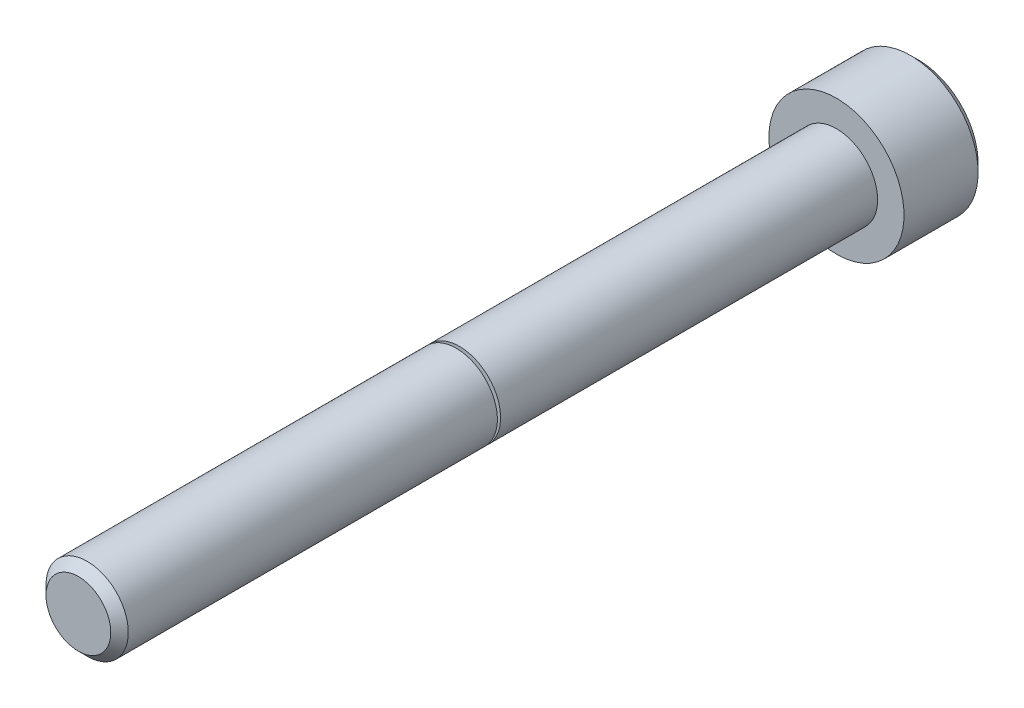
ISO-10303-21;
HEADER;
FILE_DESCRIPTION(('STEP AP214'),'2;1');
FILE_NAME('part.step','',(''),(''),'','','');
FILE_SCHEMA(('AUTOMOTIVE_DESIGN { 1 0 10303 214 1 1 1 1 }'));
ENDSEC;
DATA;
#1=APPLICATION_CONTEXT('core data for automotive mechanical design processes');
#2=APPLICATION_PROTOCOL_DEFINITION('international standard','automotive_design',2000,#1);
#3=PRODUCT_CONTEXT('',#1,'mechanical');
#4=PRODUCT('Part','Part','',(#3));
#5=PRODUCT_RELATED_PRODUCT_CATEGORY('part','',(#4));
#6=PRODUCT_DEFINITION_FORMATION('','',#4);
#7=PRODUCT_DEFINITION_CONTEXT('part definition',#1,'design');
#8=PRODUCT_DEFINITION('design','',#6,#7);
#9=PRODUCT_DEFINITION_SHAPE('','',#8);
#10=(LENGTH_UNIT() NAMED_UNIT(*) SI_UNIT(.MILLI.,.METRE.));
#11=(NAMED_UNIT(*) PLANE_ANGLE_UNIT() SI_UNIT($,.RADIAN.));
#12=(NAMED_UNIT(*) SI_UNIT($,.STERADIAN.) SOLID_ANGLE_UNIT());
#13=UNCERTAINTY_MEASURE_WITH_UNIT(LENGTH_MEASURE(1.E-05),#10,'distance_accuracy_value','');
#14=(GEOMETRIC_REPRESENTATION_CONTEXT(3) GLOBAL_UNCERTAINTY_ASSIGNED_CONTEXT((#13)) GLOBAL_UNIT_ASSIGNED_CONTEXT((#10,
#11,#12)) REPRESENTATION_CONTEXT('',''));
#15=CARTESIAN_POINT('',(0.,0.,0.));
#16=DIRECTION('',(0.,0.,1.));
#17=DIRECTION('',(1.,0.,0.));
#18=AXIS2_PLACEMENT_3D('',#15,#16,#17);
#19=CARTESIAN_POINT('',(0.,0.,-4.826));
#20=DIRECTION('',(0.,0.,1.));
#21=DIRECTION('',(1.,0.,0.));
#22=AXIS2_PLACEMENT_3D('',#19,#20,#21);
#23=PLANE('',#22);
#24=DIRECTION('',(-0.5,-0.866025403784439,0.));
#25=VECTOR('',#24,1.);
#26=CARTESIAN_POINT('',(2.29135888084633,0.,-4.826));
#27=LINE('',#26,#25);
#28=CARTESIAN_POINT('',(2.29135888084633,0.,-4.826));
#29=VERTEX_POINT('',#28);
#30=CARTESIAN_POINT('',(1.14567944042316,-1.984375,-4.826));
#31=VERTEX_POINT('',#30);
#32=EDGE_CURVE('E145',#29,#31,#27,.T.);
#33=ORIENTED_EDGE('',*,*,#32,.F.);
#34=DIRECTION('',(0.499999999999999,-0.866025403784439,0.));
#35=VECTOR('',#34,1.);
#36=CARTESIAN_POINT('',(1.14567944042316,1.984375,-4.826));
#37=LINE('',#36,#35);
#38=CARTESIAN_POINT('',(1.14567944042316,1.984375,-4.826));
#39=VERTEX_POINT('',#38);
#40=EDGE_CURVE('E64',#39,#29,#37,.T.);
#41=ORIENTED_EDGE('',*,*,#40,.F.);
#42=DIRECTION('',(1.,0.,0.));
#43=VECTOR('',#42,1.);
#44=CARTESIAN_POINT('',(-1.14567944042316,1.984375,-4.826));
#45=LINE('',#44,#43);
#46=CARTESIAN_POINT('',(-1.14567944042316,1.984375,-4.826));
#47=VERTEX_POINT('',#46);
#48=EDGE_CURVE('E158',#47,#39,#45,.T.);
#49=ORIENTED_EDGE('',*,*,#48,.F.);
#50=DIRECTION('',(0.5,0.866025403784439,0.));
#51=VECTOR('',#50,1.);
#52=CARTESIAN_POINT('',(-2.29135888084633,0.,-4.826));
#53=LINE('',#52,#51);
#54=CARTESIAN_POINT('',(-2.29135888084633,0.,-4.826));
#55=VERTEX_POINT('',#54);
#56=EDGE_CURVE('E155',#55,#47,#53,.T.);
#57=ORIENTED_EDGE('',*,*,#56,.F.);
#58=DIRECTION('',(-0.5,0.866025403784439,0.));
#59=VECTOR('',#58,1.);
#60=CARTESIAN_POINT('',(-1.14567944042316,-1.984375,-4.826));
#61=LINE('',#60,#59);
#62=CARTESIAN_POINT('',(-1.14567944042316,-1.984375,-4.826));
#63=VERTEX_POINT('',#62);
#64=EDGE_CURVE('E112',#63,#55,#61,.T.);
#65=ORIENTED_EDGE('',*,*,#64,.F.);
#66=DIRECTION('',(-1.,0.,0.));
#67=VECTOR('',#66,1.);
#68=CARTESIAN_POINT('',(1.14567944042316,-1.984375,-4.826));
#69=LINE('',#68,#67);
#70=EDGE_CURVE('E149',#31,#63,#69,.T.);
#71=ORIENTED_EDGE('',*,*,#70,.F.);
#72=EDGE_LOOP('',(#33,#41,#49,#57,#65,#71));
#73=FACE_BOUND('',#72,.T.);
#74=CARTESIAN_POINT('',(0.,0.,-4.826));
#75=DIRECTION('',(0.,0.,-1.));
#76=DIRECTION('',(-1.,0.,0.));
#77=AXIS2_PLACEMENT_3D('',#74,#75,#76);
#78=CIRCLE('',#77,3.4798);
#79=CARTESIAN_POINT('',(-3.4798,0.,-4.826));
#80=VERTEX_POINT('',#79);
#81=EDGE_CURVE('E164',#80,#80,#78,.T.);
#82=ORIENTED_EDGE('',*,*,#81,.T.);
#83=EDGE_LOOP('',(#82));
#84=FACE_BOUND('',#83,.T.);
#85=ADVANCED_FACE('F49',(#73,#84),#23,.F.);
#86=CARTESIAN_POINT('',(-1.89865000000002,0.,44.45));
#87=DIRECTION('',(0.,0.,-1.));
#88=DIRECTION('',(-1.,0.,0.));
#89=AXIS2_PLACEMENT_3D('',#86,#87,#88);
#90=PLANE('',#89);
#91=CARTESIAN_POINT('',(0.,0.,44.45));
#92=DIRECTION('',(0.,0.,-1.));
#93=DIRECTION('',(-1.,0.,0.));
#94=AXIS2_PLACEMENT_3D('',#91,#92,#93);
#95=CIRCLE('',#94,1.89865000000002);
#96=CARTESIAN_POINT('',(-1.89865000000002,0.,44.45));
#97=VERTEX_POINT('',#96);
#98=EDGE_CURVE('E11',#97,#97,#95,.T.);
#99=ORIENTED_EDGE('',*,*,#98,.F.);
#100=EDGE_LOOP('',(#99));
#101=FACE_BOUND('',#100,.T.);
#102=ADVANCED_FACE('F214',(#101),#90,.F.);
#103=CARTESIAN_POINT('',(0.,0.,44.45));
#104=DIRECTION('',(0.,0.,-1.));
#105=DIRECTION('',(-1.,0.,0.));
#106=AXIS2_PLACEMENT_3D('',#103,#104,#105);
#107=CONICAL_SURFACE('',#106,1.89865000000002,0.785398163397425);
#108=CARTESIAN_POINT('',(0.,0.,43.93565));
#109=DIRECTION('',(0.,0.,-1.));
#110=DIRECTION('',(-1.,0.,0.));
#111=AXIS2_PLACEMENT_3D('',#108,#109,#110);
#112=CIRCLE('',#111,2.41300000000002);
#113=CARTESIAN_POINT('',(-2.41300000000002,0.,43.93565));
#114=VERTEX_POINT('',#113);
#115=EDGE_CURVE('E57',#114,#114,#112,.T.);
#116=ORIENTED_EDGE('',*,*,#115,.F.);
#117=EDGE_LOOP('',(#116));
#118=FACE_BOUND('',#117,.T.);
#119=ORIENTED_EDGE('',*,*,#98,.T.);
#120=EDGE_LOOP('',(#119));
#121=FACE_BOUND('',#120,.T.);
#122=ADVANCED_FACE('F211',(#118,#121),#107,.T.);
#123=CARTESIAN_POINT('',(0.,0.,-10.585154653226));
#124=DIRECTION('',(0.,0.,-1.));
#125=DIRECTION('',(-1.,0.,0.));
#126=AXIS2_PLACEMENT_3D('',#123,#124,#125);
#127=CYLINDRICAL_SURFACE('',#126,2.41300000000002);
#128=CARTESIAN_POINT('',(0.,0.,22.2952080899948));
#129=DIRECTION('',(0.,0.,-1.));
#130=DIRECTION('',(-1.,0.,0.));
#131=AXIS2_PLACEMENT_3D('',#128,#129,#130);
#132=CIRCLE('',#131,2.41300000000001);
#133=CARTESIAN_POINT('',(-2.41300000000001,0.,22.2952080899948));
#134=VERTEX_POINT('',#133);
#135=EDGE_CURVE('E201',#134,#134,#132,.T.);
#136=ORIENTED_EDGE('',*,*,#135,.F.);
#137=EDGE_LOOP('',(#136));
#138=FACE_BOUND('',#137,.T.);
#139=ORIENTED_EDGE('',*,*,#115,.T.);
#140=EDGE_LOOP('',(#139));
#141=FACE_BOUND('',#140,.T.);
#142=ADVANCED_FACE('F209',(#138,#141),#127,.T.);
#143=CARTESIAN_POINT('',(0.,0.,22.2952080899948));
#144=DIRECTION('',(0.,0.,1.));
#145=DIRECTION('',(1.,0.,0.));
#146=AXIS2_PLACEMENT_3D('',#143,#144,#145);
#147=CONICAL_SURFACE('',#146,2.41300000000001,1.22173047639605);
#148=CARTESIAN_POINT('',(0.,0.,22.1467938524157));
#149=DIRECTION('',(0.,0.,-1.));
#150=DIRECTION('',(-1.,0.,0.));
#151=AXIS2_PLACEMENT_3D('',#148,#149,#150);
#152=CIRCLE('',#151,2.00523523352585);
#153=CARTESIAN_POINT('',(-2.00523523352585,0.,22.1467938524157));
#154=VERTEX_POINT('',#153);
#155=EDGE_CURVE('E197',#154,#154,#152,.T.);
#156=ORIENTED_EDGE('',*,*,#155,.F.);
#157=EDGE_LOOP('',(#156));
#158=FACE_BOUND('',#157,.T.);
#159=ORIENTED_EDGE('',*,*,#135,.T.);
#160=EDGE_LOOP('',(#159));
#161=FACE_BOUND('',#160,.T.);
#162=ADVANCED_FACE('F226',(#158,#161),#147,.T.);
#163=CARTESIAN_POINT('',(0.,0.,22.128));
#164=DIRECTION('',(0.,0.,-1.));
#165=DIRECTION('',(-1.,0.,0.));
#166=AXIS2_PLACEMENT_3D('',#163,#164,#165);
#167=TOROIDAL_SURFACE('',#166,2.01207563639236,0.0199999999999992);
#168=CARTESIAN_POINT('',(0.,0.,22.108));
#169=DIRECTION('',(0.,0.,-1.));
#170=DIRECTION('',(-1.,0.,0.));
#171=AXIS2_PLACEMENT_3D('',#168,#169,#170);
#172=CIRCLE('',#171,2.01207563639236);
#173=CARTESIAN_POINT('',(-2.01207563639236,0.,22.108));
#174=VERTEX_POINT('',#173);
#175=EDGE_CURVE('E193',#174,#174,#172,.T.);
#176=ORIENTED_EDGE('',*,*,#175,.F.);
#177=EDGE_LOOP('',(#176));
#178=FACE_BOUND('',#177,.T.);
#179=ORIENTED_EDGE('',*,*,#155,.T.);
#180=EDGE_LOOP('',(#179));
#181=FACE_BOUND('',#180,.T.);
#182=ADVANCED_FACE('F230',(#178,#181),#167,.F.);
#183=CARTESIAN_POINT('',(-2.41300000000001,0.,22.108));
#184=DIRECTION('',(0.,0.,-1.));
#185=DIRECTION('',(-1.,0.,0.));
#186=AXIS2_PLACEMENT_3D('',#183,#184,#185);
#187=PLANE('',#186);
#188=CARTESIAN_POINT('',(0.,0.,22.108));
#189=DIRECTION('',(0.,0.,-1.));
#190=DIRECTION('',(-1.,0.,0.));
#191=AXIS2_PLACEMENT_3D('',#188,#189,#190);
#192=CIRCLE('',#191,2.41300000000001);
#193=CARTESIAN_POINT('',(-2.41300000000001,0.,22.108));
#194=VERTEX_POINT('',#193);
#195=EDGE_CURVE('E189',#194,#194,#192,.T.);
#196=ORIENTED_EDGE('',*,*,#195,.F.);
#197=EDGE_LOOP('',(#196));
#198=FACE_BOUND('',#197,.T.);
#199=ORIENTED_EDGE('',*,*,#175,.T.);
#200=EDGE_LOOP('',(#199));
#201=FACE_BOUND('',#200,.T.);
#202=ADVANCED_FACE('F234',(#198,#201),#187,.F.);
#203=CARTESIAN_POINT('',(0.,0.,-10.585154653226));
#204=DIRECTION('',(0.,0.,-1.));
#205=DIRECTION('',(-1.,0.,0.));
#206=AXIS2_PLACEMENT_3D('',#203,#204,#205);
#207=CYLINDRICAL_SURFACE('',#206,2.41300000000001);
#208=CARTESIAN_POINT('',(0.,0.,0.));
#209=DIRECTION('',(0.,0.,-1.));
#210=DIRECTION('',(-1.,0.,0.));
#211=AXIS2_PLACEMENT_3D('',#208,#209,#210);
#212=CIRCLE('',#211,2.413);
#213=CARTESIAN_POINT('',(-2.413,0.,0.));
#214=VERTEX_POINT('',#213);
#215=EDGE_CURVE('E185',#214,#214,#212,.T.);
#216=ORIENTED_EDGE('',*,*,#215,.F.);
#217=EDGE_LOOP('',(#216));
#218=FACE_BOUND('',#217,.T.);
#219=ORIENTED_EDGE('',*,*,#195,.T.);
#220=EDGE_LOOP('',(#219));
#221=FACE_BOUND('',#220,.T.);
#222=ADVANCED_FACE('F238',(#218,#221),#207,.T.);
#223=CARTESIAN_POINT('',(-3.96240000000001,0.,0.));
#224=DIRECTION('',(0.,0.,-1.));
#225=DIRECTION('',(-1.,0.,0.));
#226=AXIS2_PLACEMENT_3D('',#223,#224,#225);
#227=PLANE('',#226);
#228=CARTESIAN_POINT('',(0.,0.,0.));
#229=DIRECTION('',(0.,0.,-1.));
#230=DIRECTION('',(-1.,0.,0.));
#231=AXIS2_PLACEMENT_3D('',#228,#229,#230);
#232=CIRCLE('',#231,3.96240000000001);
#233=CARTESIAN_POINT('',(-3.96240000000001,0.,0.));
#234=VERTEX_POINT('',#233);
#235=EDGE_CURVE('E181',#234,#234,#232,.T.);
#236=ORIENTED_EDGE('',*,*,#235,.F.);
#237=EDGE_LOOP('',(#236));
#238=FACE_BOUND('',#237,.T.);
#239=ORIENTED_EDGE('',*,*,#215,.T.);
#240=EDGE_LOOP('',(#239));
#241=FACE_BOUND('',#240,.T.);
#242=ADVANCED_FACE('F242',(#238,#241),#227,.F.);
#243=CARTESIAN_POINT('',(0.,0.,-10.585154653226));
#244=DIRECTION('',(0.,0.,-1.));
#245=DIRECTION('',(-1.,0.,0.));
#246=AXIS2_PLACEMENT_3D('',#243,#244,#245);
#247=CYLINDRICAL_SURFACE('',#246,3.9624);
#248=CARTESIAN_POINT('',(0.,0.,-4.3434));
#249=DIRECTION('',(0.,0.,-1.));
#250=DIRECTION('',(-1.,0.,0.));
#251=AXIS2_PLACEMENT_3D('',#248,#249,#250);
#252=CIRCLE('',#251,3.9624);
#253=CARTESIAN_POINT('',(-3.9624,0.,-4.3434));
#254=VERTEX_POINT('',#253);
#255=EDGE_CURVE('E177',#254,#254,#252,.T.);
#256=ORIENTED_EDGE('',*,*,#255,.F.);
#257=EDGE_LOOP('',(#256));
#258=FACE_BOUND('',#257,.T.);
#259=ORIENTED_EDGE('',*,*,#235,.T.);
#260=EDGE_LOOP('',(#259));
#261=FACE_BOUND('',#260,.T.);
#262=ADVANCED_FACE('F246',(#258,#261),#247,.T.);
#263=CARTESIAN_POINT('',(0.,0.,-4.3434));
#264=DIRECTION('',(0.,0.,1.));
#265=DIRECTION('',(1.,0.,0.));
#266=AXIS2_PLACEMENT_3D('',#263,#264,#265);
#267=CONICAL_SURFACE('',#266,3.9624,0.785398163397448);
#268=ORIENTED_EDGE('',*,*,#81,.F.);
#269=EDGE_LOOP('',(#268));
#270=FACE_BOUND('',#269,.T.);
#271=ORIENTED_EDGE('',*,*,#255,.T.);
#272=EDGE_LOOP('',(#271));
#273=FACE_BOUND('',#272,.T.);
#274=ADVANCED_FACE('F250',(#270,#273),#267,.T.);
#275=CARTESIAN_POINT('',(1.14567944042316,1.984375,-2.413));
#276=DIRECTION('',(0.866025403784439,0.499999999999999,0.));
#277=DIRECTION('',(-0.499999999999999,0.866025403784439,0.));
#278=AXIS2_PLACEMENT_3D('',#275,#276,#277);
#279=PLANE('',#278);
#280=ORIENTED_EDGE('',*,*,#40,.T.);
#281=DIRECTION('',(0.,0.,-1.));
#282=VECTOR('',#281,1.);
#283=CARTESIAN_POINT('',(2.29135888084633,0.,-2.413));
#284=LINE('',#283,#282);
#285=CARTESIAN_POINT('',(2.29135888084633,0.,-2.413));
#286=VERTEX_POINT('',#285);
#287=EDGE_CURVE('E94',#286,#29,#284,.T.);
#288=ORIENTED_EDGE('',*,*,#287,.F.);
#289=DIRECTION('',(0.499999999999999,-0.866025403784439,0.));
#290=VECTOR('',#289,1.);
#291=CARTESIAN_POINT('',(1.14567944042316,1.984375,-2.413));
#292=LINE('',#291,#290);
#293=CARTESIAN_POINT('',(1.14567944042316,1.984375,-2.413));
#294=VERTEX_POINT('',#293);
#295=EDGE_CURVE('E161',#294,#286,#292,.T.);
#296=ORIENTED_EDGE('',*,*,#295,.F.);
#297=DIRECTION('',(0.,0.,-1.));
#298=VECTOR('',#297,1.);
#299=CARTESIAN_POINT('',(1.14567944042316,1.984375,-2.413));
#300=LINE('',#299,#298);
#301=EDGE_CURVE('E72',#294,#39,#300,.T.);
#302=ORIENTED_EDGE('',*,*,#301,.T.);
#303=EDGE_LOOP('',(#280,#288,#296,#302));
#304=FACE_BOUND('',#303,.T.);
#305=ADVANCED_FACE('F254',(#304),#279,.F.);
#306=CARTESIAN_POINT('',(-1.14567944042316,1.984375,-2.413));
#307=DIRECTION('',(0.,1.,0.));
#308=DIRECTION('',(-1.,0.,0.));
#309=AXIS2_PLACEMENT_3D('',#306,#307,#308);
#310=PLANE('',#309);
#311=ORIENTED_EDGE('',*,*,#48,.T.);
#312=ORIENTED_EDGE('',*,*,#301,.F.);
#313=DIRECTION('',(1.,0.,0.));
#314=VECTOR('',#313,1.);
#315=CARTESIAN_POINT('',(-1.14567944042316,1.984375,-2.413));
#316=LINE('',#315,#314);
#317=CARTESIAN_POINT('',(-1.14567944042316,1.984375,-2.413));
#318=VERTEX_POINT('',#317);
#319=EDGE_CURVE('E126',#318,#294,#316,.T.);
#320=ORIENTED_EDGE('',*,*,#319,.F.);
#321=DIRECTION('',(0.,0.,-1.));
#322=VECTOR('',#321,1.);
#323=CARTESIAN_POINT('',(-1.14567944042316,1.984375,-2.413));
#324=LINE('',#323,#322);
#325=EDGE_CURVE('E117',#318,#47,#324,.T.);
#326=ORIENTED_EDGE('',*,*,#325,.T.);
#327=EDGE_LOOP('',(#311,#312,#320,#326));
#328=FACE_BOUND('',#327,.T.);
#329=ADVANCED_FACE('F258',(#328),#310,.F.);
#330=CARTESIAN_POINT('',(-2.29135888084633,0.,-2.413));
#331=DIRECTION('',(-0.866025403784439,0.5,0.));
#332=DIRECTION('',(-0.5,-0.866025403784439,0.));
#333=AXIS2_PLACEMENT_3D('',#330,#331,#332);
#334=PLANE('',#333);
#335=ORIENTED_EDGE('',*,*,#56,.T.);
#336=ORIENTED_EDGE('',*,*,#325,.F.);
#337=DIRECTION('',(0.5,0.866025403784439,0.));
#338=VECTOR('',#337,1.);
#339=CARTESIAN_POINT('',(-2.29135888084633,0.,-2.413));
#340=LINE('',#339,#338);
#341=CARTESIAN_POINT('',(-2.29135888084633,0.,-2.413));
#342=VERTEX_POINT('',#341);
#343=EDGE_CURVE('E121',#342,#318,#340,.T.);
#344=ORIENTED_EDGE('',*,*,#343,.F.);
#345=DIRECTION('',(0.,0.,-1.));
#346=VECTOR('',#345,1.);
#347=CARTESIAN_POINT('',(-2.29135888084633,0.,-2.413));
#348=LINE('',#347,#346);
#349=EDGE_CURVE('E105',#342,#55,#348,.T.);
#350=ORIENTED_EDGE('',*,*,#349,.T.);
#351=EDGE_LOOP('',(#335,#336,#344,#350));
#352=FACE_BOUND('',#351,.T.);
#353=ADVANCED_FACE('F122',(#352),#334,.F.);
#354=CARTESIAN_POINT('',(-1.14567944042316,-1.984375,-2.413));
#355=DIRECTION('',(-0.866025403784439,-0.5,0.));
#356=DIRECTION('',(0.5,-0.866025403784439,0.));
#357=AXIS2_PLACEMENT_3D('',#354,#355,#356);
#358=PLANE('',#357);
#359=ORIENTED_EDGE('',*,*,#64,.T.);
#360=ORIENTED_EDGE('',*,*,#349,.F.);
#361=DIRECTION('',(-0.5,0.866025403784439,0.));
#362=VECTOR('',#361,1.);
#363=CARTESIAN_POINT('',(-1.14567944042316,-1.984375,-2.413));
#364=LINE('',#363,#362);
#365=CARTESIAN_POINT('',(-1.14567944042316,-1.984375,-2.413));
#366=VERTEX_POINT('',#365);
#367=EDGE_CURVE('E109',#366,#342,#364,.T.);
#368=ORIENTED_EDGE('',*,*,#367,.F.);
#369=DIRECTION('',(0.,0.,-1.));
#370=VECTOR('',#369,1.);
#371=CARTESIAN_POINT('',(-1.14567944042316,-1.984375,-2.413));
#372=LINE('',#371,#370);
#373=EDGE_CURVE('E118',#366,#63,#372,.T.);
#374=ORIENTED_EDGE('',*,*,#373,.T.);
#375=EDGE_LOOP('',(#359,#360,#368,#374));
#376=FACE_BOUND('',#375,.T.);
#377=ADVANCED_FACE('F107',(#376),#358,.F.);
#378=CARTESIAN_POINT('',(1.14567944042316,-1.984375,-2.413));
#379=DIRECTION('',(0.,-1.,0.));
#380=DIRECTION('',(1.,0.,0.));
#381=AXIS2_PLACEMENT_3D('',#378,#379,#380);
#382=PLANE('',#381);
#383=ORIENTED_EDGE('',*,*,#70,.T.);
#384=ORIENTED_EDGE('',*,*,#373,.F.);
#385=DIRECTION('',(-1.,0.,0.));
#386=VECTOR('',#385,1.);
#387=CARTESIAN_POINT('',(1.14567944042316,-1.984375,-2.413));
#388=LINE('',#387,#386);
#389=CARTESIAN_POINT('',(1.14567944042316,-1.984375,-2.413));
#390=VERTEX_POINT('',#389);
#391=EDGE_CURVE('E132',#390,#366,#388,.T.);
#392=ORIENTED_EDGE('',*,*,#391,.F.);
#393=DIRECTION('',(0.,0.,-1.));
#394=VECTOR('',#393,1.);
#395=CARTESIAN_POINT('',(1.14567944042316,-1.984375,-2.413));
#396=LINE('',#395,#394);
#397=EDGE_CURVE('E169',#390,#31,#396,.T.);
#398=ORIENTED_EDGE('',*,*,#397,.T.);
#399=EDGE_LOOP('',(#383,#384,#392,#398));
#400=FACE_BOUND('',#399,.T.);
#401=ADVANCED_FACE('F262',(#400),#382,.F.);
#402=CARTESIAN_POINT('',(2.29135888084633,0.,-2.413));
#403=DIRECTION('',(0.866025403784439,-0.5,0.));
#404=DIRECTION('',(0.5,0.866025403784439,0.));
#405=AXIS2_PLACEMENT_3D('',#402,#403,#404);
#406=PLANE('',#405);
#407=ORIENTED_EDGE('',*,*,#32,.T.);
#408=ORIENTED_EDGE('',*,*,#397,.F.);
#409=DIRECTION('',(-0.5,-0.866025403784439,0.));
#410=VECTOR('',#409,1.);
#411=CARTESIAN_POINT('',(2.29135888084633,0.,-2.413));
#412=LINE('',#411,#410);
#413=EDGE_CURVE('E137',#286,#390,#412,.T.);
#414=ORIENTED_EDGE('',*,*,#413,.F.);
#415=ORIENTED_EDGE('',*,*,#287,.T.);
#416=EDGE_LOOP('',(#407,#408,#414,#415));
#417=FACE_BOUND('',#416,.T.);
#418=ADVANCED_FACE('F259',(#417),#406,.F.);
#419=CARTESIAN_POINT('',(3.43703832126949,-1.984375,-2.413));
#420=DIRECTION('',(0.,0.,-1.));
#421=DIRECTION('',(-1.,0.,0.));
#422=AXIS2_PLACEMENT_3D('',#419,#420,#421);
#423=PLANE('',#422);
#424=ORIENTED_EDGE('',*,*,#295,.T.);
#425=ORIENTED_EDGE('',*,*,#413,.T.);
#426=ORIENTED_EDGE('',*,*,#391,.T.);
#427=ORIENTED_EDGE('',*,*,#367,.T.);
#428=ORIENTED_EDGE('',*,*,#343,.T.);
#429=ORIENTED_EDGE('',*,*,#319,.T.);
#430=EDGE_LOOP('',(#424,#425,#426,#427,#428,#429));
#431=FACE_BOUND('',#430,.T.);
#432=ADVANCED_FACE('F129',(#431),#423,.T.);
#433=CLOSED_SHELL('',(#85,#102,#122,#142,#162,#182,#202,#222,#242,#262,#274,#305,#329,#353,#377,
#401,#418,#432));
#434=MANIFOLD_SOLID_BREP('B2',#433);
#435=ADVANCED_BREP_SHAPE_REPRESENTATION('',(#18,#434),#14);
#436=SHAPE_DEFINITION_REPRESENTATION(#9,#435);
ENDSEC;
END-ISO-10303-21;
